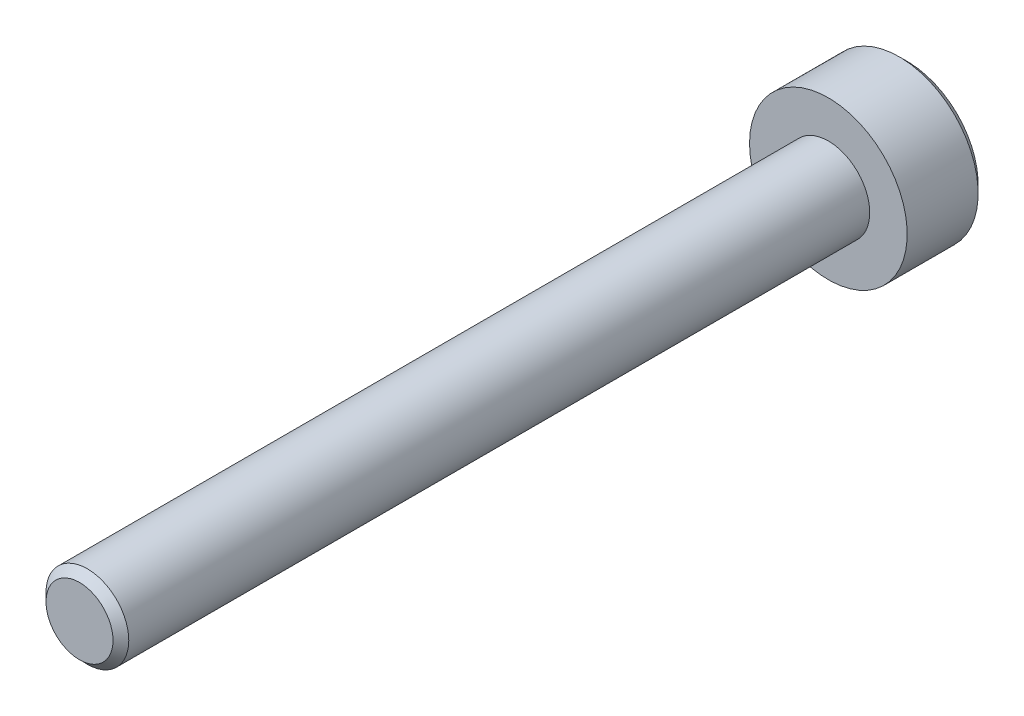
from build123d import *

# Parameters (mm, degrees)
ESQUISSE1_R        = 5.25
BOSS_EXTRU_1_DEPTH = 95
ESQUISSE2_R        = 10
BOSS_EXTRU_2_DEPTH = 10
CHANFREIN1_SIZE    = 1


with BuildPart() as part:
    # Esquisse1 → Boss.-Extru.1 (new body)
    with BuildSketch(Plane.XY):
        Circle(ESQUISSE1_R)
    extrude(amount=BOSS_EXTRU_1_DEPTH)

    # Esquisse2 → Boss.-Extru.2 (add)
    with BuildSketch(Plane(origin=(0, 0, 0), x_dir=(-1, 0, 0), z_dir=(0, 0, -1))):
        Circle(ESQUISSE2_R)
    extrude(amount=BOSS_EXTRU_2_DEPTH)

    # Chanfrein1
    chanfrein1_edges = [part.edges().sort_by_distance(p)[0] for p in [
        (-5.25, 0, 95),
        (10, 0, -10),
    ]]
    chamfer(chanfrein1_edges, length=CHANFREIN1_SIZE)


solid = part.part
